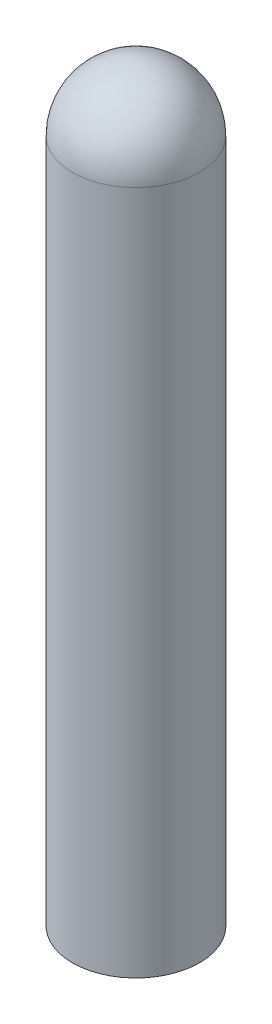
from build123d import *

# Parameters (mm, degrees)
ESQUISSE1_R       = 3.25
EXTRUSION1_DEPTH  = 35
D_ME1_FACE_RADIUS = 3.25
D_ME1_HEIGHT      = 3.25


with BuildPart() as part:
    # Esquisse1 → Extrusion1 (new body)
    with BuildSketch(Plane(origin=(0, 0, 0), x_dir=(1, 0, 0), z_dir=(0, 1, 0))):
        with Locations(Location((0, 0, 0), (0, 0, 270))):
            Circle(ESQUISSE1_R)
    extrude(amount=EXTRUSION1_DEPTH)

    # D_me1: a dome of height H over a round flat face of radius A is a cap of a sphere of radius (A * A + H * H) / (2 * H)
    d_me1_r = (D_ME1_FACE_RADIUS * D_ME1_FACE_RADIUS + D_ME1_HEIGHT * D_ME1_HEIGHT) / (2 * D_ME1_HEIGHT)
    d_me1_base = Plane((0, 35, 0), z_dir=(0, 1, 0))
    with Locations(d_me1_base.offset(D_ME1_HEIGHT - d_me1_r)):
        d_me1_ball = Sphere(d_me1_r, mode=Mode.PRIVATE)
    add(split(d_me1_ball, bisect_by=d_me1_base, keep=Keep.TOP, mode=Mode.PRIVATE))


solid = part.part
